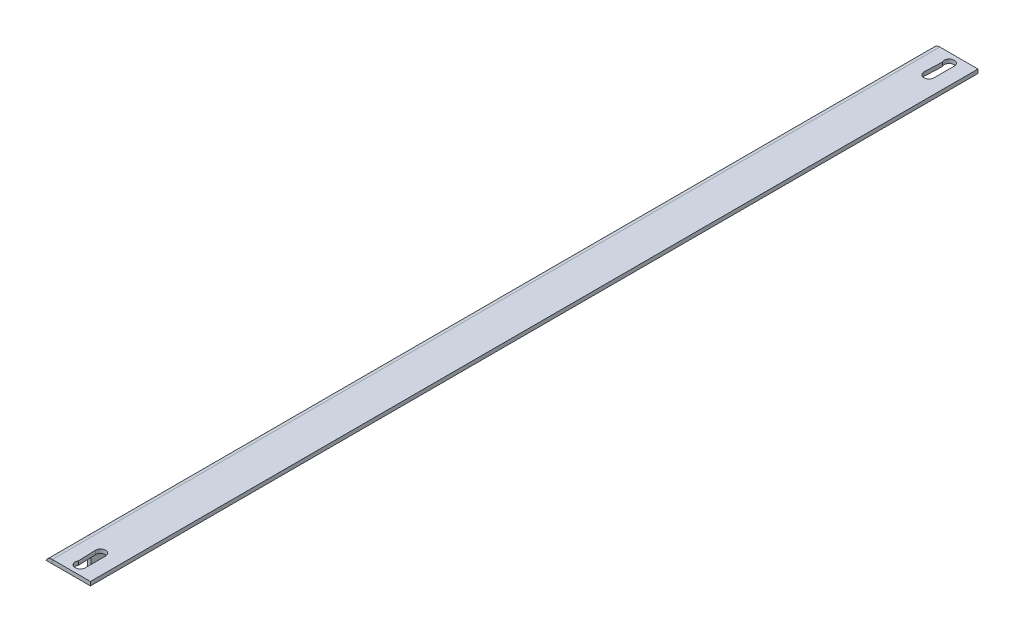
ISO-10303-21;
HEADER;
FILE_DESCRIPTION(('STEP AP214'),'2;1');
FILE_NAME('part.step','',(''),(''),'','','');
FILE_SCHEMA(('AUTOMOTIVE_DESIGN { 1 0 10303 214 1 1 1 1 }'));
ENDSEC;
DATA;
#1=APPLICATION_CONTEXT('core data for automotive mechanical design processes');
#2=APPLICATION_PROTOCOL_DEFINITION('international standard','automotive_design',2000,#1);
#3=PRODUCT_CONTEXT('',#1,'mechanical');
#4=PRODUCT('Part','Part','',(#3));
#5=PRODUCT_RELATED_PRODUCT_CATEGORY('part','',(#4));
#6=PRODUCT_DEFINITION_FORMATION('','',#4);
#7=PRODUCT_DEFINITION_CONTEXT('part definition',#1,'design');
#8=PRODUCT_DEFINITION('design','',#6,#7);
#9=PRODUCT_DEFINITION_SHAPE('','',#8);
#10=(LENGTH_UNIT() NAMED_UNIT(*) SI_UNIT(.MILLI.,.METRE.));
#11=(NAMED_UNIT(*) PLANE_ANGLE_UNIT() SI_UNIT($,.RADIAN.));
#12=(NAMED_UNIT(*) SI_UNIT($,.STERADIAN.) SOLID_ANGLE_UNIT());
#13=UNCERTAINTY_MEASURE_WITH_UNIT(LENGTH_MEASURE(1.E-05),#10,'distance_accuracy_value','');
#14=(GEOMETRIC_REPRESENTATION_CONTEXT(3) GLOBAL_UNCERTAINTY_ASSIGNED_CONTEXT((#13)) GLOBAL_UNIT_ASSIGNED_CONTEXT((#10,
#11,#12)) REPRESENTATION_CONTEXT('',''));
#15=CARTESIAN_POINT('',(0.,0.,0.));
#16=DIRECTION('',(0.,0.,1.));
#17=DIRECTION('',(1.,0.,0.));
#18=AXIS2_PLACEMENT_3D('',#15,#16,#17);
#19=CARTESIAN_POINT('',(-21.0535097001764,47.6637389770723,570.));
#20=DIRECTION('',(0.,1.,0.));
#21=DIRECTION('',(0.,0.,1.));
#22=AXIS2_PLACEMENT_3D('',#19,#20,#21);
#23=PLANE('',#22);
#24=DIRECTION('',(0.,0.,-1.));
#25=VECTOR('',#24,1.);
#26=CARTESIAN_POINT('',(-17.0535097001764,47.6637389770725,-570.));
#27=LINE('',#26,#25);
#28=CARTESIAN_POINT('',(-17.0535097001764,47.6637389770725,516.));
#29=VERTEX_POINT('',#28);
#30=CARTESIAN_POINT('',(-17.0535097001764,47.6637389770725,-516.));
#31=VERTEX_POINT('',#30);
#32=EDGE_CURVE('E356',#29,#31,#27,.T.);
#33=ORIENTED_EDGE('',*,*,#32,.T.);
#34=DIRECTION('',(1.,0.,0.));
#35=VECTOR('',#34,1.);
#36=CARTESIAN_POINT('',(-91.0535097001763,47.6637389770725,-516.));
#37=LINE('',#36,#35);
#38=CARTESIAN_POINT('',(-25.1157674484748,47.6637389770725,-516.));
#39=VERTEX_POINT('',#38);
#40=EDGE_CURVE('E288',#39,#31,#37,.T.);
#41=ORIENTED_EDGE('',*,*,#40,.F.);
#42=DIRECTION('',(0.,0.,1.));
#43=VECTOR('',#42,1.);
#44=CARTESIAN_POINT('',(-25.1157674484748,47.6637389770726,-1715.51287387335));
#45=LINE('',#44,#43);
#46=CARTESIAN_POINT('',(-25.1157674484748,47.6637389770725,-570.));
#47=VERTEX_POINT('',#46);
#48=EDGE_CURVE('E290',#39,#47,#45,.F.);
#49=ORIENTED_EDGE('',*,*,#48,.T.);
#50=DIRECTION('',(1.,0.,0.));
#51=VECTOR('',#50,1.);
#52=CARTESIAN_POINT('',(-91.0535097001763,47.6637389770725,-570.));
#53=LINE('',#52,#51);
#54=CARTESIAN_POINT('',(-17.0535097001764,47.6637389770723,-570.));
#55=VERTEX_POINT('',#54);
#56=EDGE_CURVE('E287',#47,#55,#53,.T.);
#57=ORIENTED_EDGE('',*,*,#56,.T.);
#58=DIRECTION('',(1.,0.,0.));
#59=VECTOR('',#58,1.);
#60=CARTESIAN_POINT('',(-21.0535097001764,47.6637389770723,-570.));
#61=LINE('',#60,#59);
#62=CARTESIAN_POINT('',(31.9464902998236,47.6637389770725,-570.));
#63=VERTEX_POINT('',#62);
#64=EDGE_CURVE('E351',#55,#63,#61,.T.);
#65=ORIENTED_EDGE('',*,*,#64,.T.);
#66=DIRECTION('',(0.,0.,-1.));
#67=VECTOR('',#66,1.);
#68=CARTESIAN_POINT('',(31.9464902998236,47.6637389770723,570.));
#69=LINE('',#68,#67);
#70=CARTESIAN_POINT('',(31.9464902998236,47.6637389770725,570.));
#71=VERTEX_POINT('',#70);
#72=EDGE_CURVE('E354',#71,#63,#69,.T.);
#73=ORIENTED_EDGE('',*,*,#72,.F.);
#74=DIRECTION('',(-1.,0.,0.));
#75=VECTOR('',#74,1.);
#76=CARTESIAN_POINT('',(-21.0535097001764,47.6637389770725,570.));
#77=LINE('',#76,#75);
#78=CARTESIAN_POINT('',(-17.0535097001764,47.6637389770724,569.999999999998));
#79=VERTEX_POINT('',#78);
#80=EDGE_CURVE('E370',#71,#79,#77,.T.);
#81=ORIENTED_EDGE('',*,*,#80,.T.);
#82=DIRECTION('',(-1.,0.,0.));
#83=VECTOR('',#82,1.);
#84=CARTESIAN_POINT('',(-17.0535097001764,47.6637389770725,570.));
#85=LINE('',#84,#83);
#86=CARTESIAN_POINT('',(-25.1157674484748,47.6637389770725,570.));
#87=VERTEX_POINT('',#86);
#88=EDGE_CURVE('E319',#79,#87,#85,.T.);
#89=ORIENTED_EDGE('',*,*,#88,.T.);
#90=DIRECTION('',(0.,0.,1.));
#91=VECTOR('',#90,1.);
#92=CARTESIAN_POINT('',(-25.1157674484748,47.6637389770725,-1715.51287387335));
#93=LINE('',#92,#91);
#94=CARTESIAN_POINT('',(-25.1157674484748,47.6637389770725,516.));
#95=VERTEX_POINT('',#94);
#96=EDGE_CURVE('E321',#87,#95,#93,.F.);
#97=ORIENTED_EDGE('',*,*,#96,.T.);
#98=DIRECTION('',(1.,0.,0.));
#99=VECTOR('',#98,1.);
#100=CARTESIAN_POINT('',(-91.0535097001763,47.6637389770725,516.));
#101=LINE('',#100,#99);
#102=EDGE_CURVE('E304',#95,#29,#101,.T.);
#103=ORIENTED_EDGE('',*,*,#102,.T.);
#104=EDGE_LOOP('',(#33,#41,#49,#57,#65,#73,#81,#89,#97,#103));
#105=FACE_BOUND('',#104,.T.);
#106=DIRECTION('',(0.0384616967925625,0.,0.99926007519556));
#107=VECTOR('',#106,1.);
#108=CARTESIAN_POINT('',(1.87034239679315,47.6637389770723,569.117656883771));
#109=LINE('',#108,#107);
#110=CARTESIAN_POINT('',(0.45129981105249,47.6637389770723,532.250001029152));
#111=VERTEX_POINT('',#110);
#112=CARTESIAN_POINT('',(1.31732852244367,47.6637389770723,554.749994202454));
#113=VERTEX_POINT('',#112);
#114=EDGE_CURVE('E221',#111,#113,#109,.T.);
#115=ORIENTED_EDGE('',*,*,#114,.T.);
#116=CARTESIAN_POINT('',(6.94649029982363,47.6637389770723,558.));
#117=DIRECTION('',(0.,1.,0.));
#118=DIRECTION('',(0.,0.,1.));
#119=AXIS2_PLACEMENT_3D('',#116,#117,#118);
#120=CIRCLE('',#119,6.5);
#121=CARTESIAN_POINT('',(13.4464902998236,47.6637389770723,558.));
#122=VERTEX_POINT('',#121);
#123=EDGE_CURVE('E224',#113,#122,#120,.T.);
#124=ORIENTED_EDGE('',*,*,#123,.T.);
#125=DIRECTION('',(0.,0.,-1.));
#126=VECTOR('',#125,1.);
#127=CARTESIAN_POINT('',(13.4464902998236,47.6637389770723,570.));
#128=LINE('',#127,#126);
#129=CARTESIAN_POINT('',(13.4464902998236,47.6637389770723,532.));
#130=VERTEX_POINT('',#129);
#131=EDGE_CURVE('E209',#122,#130,#128,.T.);
#132=ORIENTED_EDGE('',*,*,#131,.T.);
#133=CARTESIAN_POINT('',(6.94649029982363,47.6637389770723,532.));
#134=DIRECTION('',(0.,1.,0.));
#135=DIRECTION('',(0.,0.,1.));
#136=AXIS2_PLACEMENT_3D('',#133,#134,#135);
#137=CIRCLE('',#136,6.5);
#138=EDGE_CURVE('E218',#130,#111,#137,.T.);
#139=ORIENTED_EDGE('',*,*,#138,.T.);
#140=EDGE_LOOP('',(#115,#124,#132,#139));
#141=FACE_BOUND('',#140,.T.);
#142=CARTESIAN_POINT('',(6.94649029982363,47.6637389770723,-558.));
#143=DIRECTION('',(0.,1.,0.));
#144=DIRECTION('',(0.,0.,1.));
#145=AXIS2_PLACEMENT_3D('',#142,#143,#144);
#146=CIRCLE('',#145,6.5);
#147=CARTESIAN_POINT('',(1.31732852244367,47.6637389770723,-554.749994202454));
#148=VERTEX_POINT('',#147);
#149=CARTESIAN_POINT('',(13.4464902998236,47.6637389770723,-558.));
#150=VERTEX_POINT('',#149);
#151=EDGE_CURVE('E193',#148,#150,#146,.F.);
#152=ORIENTED_EDGE('',*,*,#151,.F.);
#153=DIRECTION('',(0.0384616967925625,0.,-0.99926007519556));
#154=VECTOR('',#153,1.);
#155=CARTESIAN_POINT('',(-41.9435489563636,47.6637389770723,569.195938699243));
#156=LINE('',#155,#154);
#157=CARTESIAN_POINT('',(0.451299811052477,47.6637389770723,-532.250001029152));
#158=VERTEX_POINT('',#157);
#159=EDGE_CURVE('E186',#158,#148,#156,.T.);
#160=ORIENTED_EDGE('',*,*,#159,.F.);
#161=CARTESIAN_POINT('',(6.94649029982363,47.6637389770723,-532.));
#162=DIRECTION('',(0.,1.,0.));
#163=DIRECTION('',(0.,0.,1.));
#164=AXIS2_PLACEMENT_3D('',#161,#162,#163);
#165=CIRCLE('',#164,6.5);
#166=CARTESIAN_POINT('',(13.4464902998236,47.6637389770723,-532.));
#167=VERTEX_POINT('',#166);
#168=EDGE_CURVE('E167',#167,#158,#165,.F.);
#169=ORIENTED_EDGE('',*,*,#168,.F.);
#170=DIRECTION('',(0.,0.,1.));
#171=VECTOR('',#170,1.);
#172=CARTESIAN_POINT('',(13.4464902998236,47.6637389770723,570.));
#173=LINE('',#172,#171);
#174=EDGE_CURVE('E191',#150,#167,#173,.T.);
#175=ORIENTED_EDGE('',*,*,#174,.F.);
#176=EDGE_LOOP('',(#152,#160,#169,#175));
#177=FACE_BOUND('',#176,.T.);
#178=ADVANCED_FACE('F30',(#105,#141,#177),#23,.F.);
#179=CARTESIAN_POINT('',(31.9464902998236,52.6637389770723,570.));
#180=DIRECTION('',(0.,-1.,0.));
#181=DIRECTION('',(1.,0.,0.));
#182=AXIS2_PLACEMENT_3D('',#179,#180,#181);
#183=PLANE('',#182);
#184=DIRECTION('',(-1.,0.,0.));
#185=VECTOR('',#184,1.);
#186=CARTESIAN_POINT('',(31.9464902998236,52.6637389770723,-570.));
#187=LINE('',#186,#185);
#188=CARTESIAN_POINT('',(31.9464902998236,52.6637389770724,-570.));
#189=VERTEX_POINT('',#188);
#190=CARTESIAN_POINT('',(-17.0535097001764,52.6637389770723,-570.));
#191=VERTEX_POINT('',#190);
#192=EDGE_CURVE('E332',#189,#191,#187,.T.);
#193=ORIENTED_EDGE('',*,*,#192,.T.);
#194=DIRECTION('',(0.,0.,1.));
#195=VECTOR('',#194,1.);
#196=CARTESIAN_POINT('',(-17.0535097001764,52.6637389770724,-570.));
#197=LINE('',#196,#195);
#198=CARTESIAN_POINT('',(-17.0535097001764,52.6637389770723,570.));
#199=VERTEX_POINT('',#198);
#200=EDGE_CURVE('E348',#191,#199,#197,.T.);
#201=ORIENTED_EDGE('',*,*,#200,.T.);
#202=DIRECTION('',(-1.,0.,0.));
#203=VECTOR('',#202,1.);
#204=CARTESIAN_POINT('',(31.9464902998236,52.6637389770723,570.));
#205=LINE('',#204,#203);
#206=CARTESIAN_POINT('',(31.9464902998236,52.6637389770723,570.));
#207=VERTEX_POINT('',#206);
#208=EDGE_CURVE('E342',#207,#199,#205,.T.);
#209=ORIENTED_EDGE('',*,*,#208,.F.);
#210=DIRECTION('',(0.,0.,-1.));
#211=VECTOR('',#210,1.);
#212=CARTESIAN_POINT('',(31.9464902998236,52.6637389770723,570.));
#213=LINE('',#212,#211);
#214=EDGE_CURVE('E345',#207,#189,#213,.T.);
#215=ORIENTED_EDGE('',*,*,#214,.T.);
#216=EDGE_LOOP('',(#193,#201,#209,#215));
#217=FACE_BOUND('',#216,.T.);
#218=DIRECTION('',(0.,0.,-1.));
#219=VECTOR('',#218,1.);
#220=CARTESIAN_POINT('',(13.4464902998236,52.6637389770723,558.));
#221=LINE('',#220,#219);
#222=CARTESIAN_POINT('',(13.4464902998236,52.6637389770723,558.));
#223=VERTEX_POINT('',#222);
#224=CARTESIAN_POINT('',(13.4464902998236,52.6637389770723,532.));
#225=VERTEX_POINT('',#224);
#226=EDGE_CURVE('E197',#223,#225,#221,.T.);
#227=ORIENTED_EDGE('',*,*,#226,.F.);
#228=CARTESIAN_POINT('',(6.94649029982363,52.6637389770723,558.));
#229=DIRECTION('',(0.,1.,0.));
#230=DIRECTION('',(-1.,0.,0.));
#231=AXIS2_PLACEMENT_3D('',#228,#229,#230);
#232=CIRCLE('',#231,6.5);
#233=CARTESIAN_POINT('',(1.31732852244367,52.6637389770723,554.749994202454));
#234=VERTEX_POINT('',#233);
#235=EDGE_CURVE('E195',#234,#223,#232,.T.);
#236=ORIENTED_EDGE('',*,*,#235,.F.);
#237=DIRECTION('',(0.0384616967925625,0.,0.99926007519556));
#238=VECTOR('',#237,1.);
#239=CARTESIAN_POINT('',(1.31732852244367,52.6637389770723,554.749994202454));
#240=LINE('',#239,#238);
#241=CARTESIAN_POINT('',(0.451299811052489,52.6637389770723,532.250001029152));
#242=VERTEX_POINT('',#241);
#243=EDGE_CURVE('E203',#242,#234,#240,.T.);
#244=ORIENTED_EDGE('',*,*,#243,.F.);
#245=CARTESIAN_POINT('',(6.94649029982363,52.6637389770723,532.));
#246=DIRECTION('',(0.,1.,0.));
#247=DIRECTION('',(-1.,0.,0.));
#248=AXIS2_PLACEMENT_3D('',#245,#246,#247);
#249=CIRCLE('',#248,6.5);
#250=EDGE_CURVE('E200',#225,#242,#249,.T.);
#251=ORIENTED_EDGE('',*,*,#250,.F.);
#252=EDGE_LOOP('',(#227,#236,#244,#251));
#253=FACE_BOUND('',#252,.T.);
#254=CARTESIAN_POINT('',(6.94649029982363,52.6637389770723,-558.));
#255=DIRECTION('',(0.,-1.,0.));
#256=DIRECTION('',(-1.,0.,0.));
#257=AXIS2_PLACEMENT_3D('',#254,#255,#256);
#258=CIRCLE('',#257,6.5);
#259=CARTESIAN_POINT('',(1.31732852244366,52.6637389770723,-554.749994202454));
#260=VERTEX_POINT('',#259);
#261=CARTESIAN_POINT('',(13.4464902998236,52.6637389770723,-558.));
#262=VERTEX_POINT('',#261);
#263=EDGE_CURVE('E53',#260,#262,#258,.T.);
#264=ORIENTED_EDGE('',*,*,#263,.T.);
#265=DIRECTION('',(0.,0.,1.));
#266=VECTOR('',#265,1.);
#267=CARTESIAN_POINT('',(13.4464902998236,52.6637389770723,-558.));
#268=LINE('',#267,#266);
#269=CARTESIAN_POINT('',(13.4464902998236,52.6637389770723,-532.));
#270=VERTEX_POINT('',#269);
#271=EDGE_CURVE('E179',#262,#270,#268,.T.);
#272=ORIENTED_EDGE('',*,*,#271,.T.);
#273=CARTESIAN_POINT('',(6.94649029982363,52.6637389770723,-532.));
#274=DIRECTION('',(0.,-1.,0.));
#275=DIRECTION('',(-1.,0.,0.));
#276=AXIS2_PLACEMENT_3D('',#273,#274,#275);
#277=CIRCLE('',#276,6.5);
#278=CARTESIAN_POINT('',(0.451299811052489,52.6637389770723,-532.250001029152));
#279=VERTEX_POINT('',#278);
#280=EDGE_CURVE('E164',#270,#279,#277,.T.);
#281=ORIENTED_EDGE('',*,*,#280,.T.);
#282=DIRECTION('',(0.0384616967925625,0.,-0.99926007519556));
#283=VECTOR('',#282,1.);
#284=CARTESIAN_POINT('',(1.31732852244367,52.6637389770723,-554.749994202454));
#285=LINE('',#284,#283);
#286=EDGE_CURVE('E173',#279,#260,#285,.T.);
#287=ORIENTED_EDGE('',*,*,#286,.T.);
#288=EDGE_LOOP('',(#264,#272,#281,#287));
#289=FACE_BOUND('',#288,.T.);
#290=ADVANCED_FACE('F177',(#217,#253,#289),#183,.F.);
#291=CARTESIAN_POINT('',(-21.0535097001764,-2234.44142950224,-570.));
#292=DIRECTION('',(0.,0.,1.));
#293=DIRECTION('',(0.,-1.,0.));
#294=AXIS2_PLACEMENT_3D('',#291,#292,#293);
#295=PLANE('',#294);
#296=DIRECTION('',(0.,1.,0.));
#297=VECTOR('',#296,1.);
#298=CARTESIAN_POINT('',(-17.0535097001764,-2234.44142950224,-570.));
#299=LINE('',#298,#297);
#300=EDGE_CURVE('E367',#55,#191,#299,.T.);
#301=ORIENTED_EDGE('',*,*,#300,.T.);
#302=ORIENTED_EDGE('',*,*,#192,.F.);
#303=DIRECTION('',(0.,1.,0.));
#304=VECTOR('',#303,1.);
#305=CARTESIAN_POINT('',(31.9464902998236,-2234.44142950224,-570.));
#306=LINE('',#305,#304);
#307=EDGE_CURVE('E364',#63,#189,#306,.T.);
#308=ORIENTED_EDGE('',*,*,#307,.F.);
#309=ORIENTED_EDGE('',*,*,#64,.F.);
#310=EDGE_LOOP('',(#301,#302,#308,#309));
#311=FACE_BOUND('',#310,.T.);
#312=ADVANCED_FACE('F32',(#311),#295,.F.);
#313=CARTESIAN_POINT('',(31.9464902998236,-2234.44142950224,570.));
#314=DIRECTION('',(1.,0.,0.));
#315=DIRECTION('',(0.,1.,0.));
#316=AXIS2_PLACEMENT_3D('',#313,#314,#315);
#317=PLANE('',#316);
#318=ORIENTED_EDGE('',*,*,#214,.F.);
#319=DIRECTION('',(0.,1.,0.));
#320=VECTOR('',#319,1.);
#321=CARTESIAN_POINT('',(31.9464902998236,-2234.44142950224,570.));
#322=LINE('',#321,#320);
#323=EDGE_CURVE('E362',#71,#207,#322,.T.);
#324=ORIENTED_EDGE('',*,*,#323,.F.);
#325=ORIENTED_EDGE('',*,*,#72,.T.);
#326=ORIENTED_EDGE('',*,*,#307,.T.);
#327=EDGE_LOOP('',(#318,#324,#325,#326));
#328=FACE_BOUND('',#327,.T.);
#329=ADVANCED_FACE('F410',(#328),#317,.T.);
#330=CARTESIAN_POINT('',(-21.0535097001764,-2234.44142950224,570.));
#331=DIRECTION('',(0.,0.,1.));
#332=DIRECTION('',(0.,-1.,0.));
#333=AXIS2_PLACEMENT_3D('',#330,#331,#332);
#334=PLANE('',#333);
#335=ORIENTED_EDGE('',*,*,#208,.T.);
#336=DIRECTION('',(0.,1.,0.));
#337=VECTOR('',#336,1.);
#338=CARTESIAN_POINT('',(-17.0535097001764,-2234.44142950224,570.));
#339=LINE('',#338,#337);
#340=EDGE_CURVE('E359',#79,#199,#339,.T.);
#341=ORIENTED_EDGE('',*,*,#340,.F.);
#342=ORIENTED_EDGE('',*,*,#80,.F.);
#343=ORIENTED_EDGE('',*,*,#323,.T.);
#344=EDGE_LOOP('',(#335,#341,#342,#343));
#345=FACE_BOUND('',#344,.T.);
#346=ADVANCED_FACE('F413',(#345),#334,.T.);
#347=CARTESIAN_POINT('',(2261.05165877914,-5.3362610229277,570.));
#348=DIRECTION('',(0.,1.,0.));
#349=DIRECTION('',(0.,0.,1.));
#350=AXIS2_PLACEMENT_3D('',#347,#348,#349);
#351=PLANE('',#350);
#352=DIRECTION('',(0.,0.,-1.));
#353=VECTOR('',#352,1.);
#354=CARTESIAN_POINT('',(-26.0535097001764,-5.3362610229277,570.));
#355=LINE('',#354,#353);
#356=CARTESIAN_POINT('',(-26.0535097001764,-5.3362610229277,516.));
#357=VERTEX_POINT('',#356);
#358=CARTESIAN_POINT('',(-26.0535097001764,-5.3362610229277,-516.));
#359=VERTEX_POINT('',#358);
#360=EDGE_CURVE('E333',#357,#359,#355,.T.);
#361=ORIENTED_EDGE('',*,*,#360,.T.);
#362=DIRECTION('',(1.,0.,0.));
#363=VECTOR('',#362,1.);
#364=CARTESIAN_POINT('',(2261.05165877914,-5.3362610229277,-516.));
#365=LINE('',#364,#363);
#366=CARTESIAN_POINT('',(-21.0535097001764,-5.3362610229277,-516.));
#367=VERTEX_POINT('',#366);
#368=EDGE_CURVE('E296',#359,#367,#365,.T.);
#369=ORIENTED_EDGE('',*,*,#368,.T.);
#370=DIRECTION('',(0.,0.,-1.));
#371=VECTOR('',#370,1.);
#372=CARTESIAN_POINT('',(-21.0535097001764,-5.3362610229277,570.));
#373=LINE('',#372,#371);
#374=CARTESIAN_POINT('',(-21.0535097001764,-5.3362610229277,516.));
#375=VERTEX_POINT('',#374);
#376=EDGE_CURVE('E329',#375,#367,#373,.T.);
#377=ORIENTED_EDGE('',*,*,#376,.F.);
#378=DIRECTION('',(-1.,0.,0.));
#379=VECTOR('',#378,1.);
#380=CARTESIAN_POINT('',(2261.05165877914,-5.3362610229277,516.));
#381=LINE('',#380,#379);
#382=EDGE_CURVE('E310',#375,#357,#381,.T.);
#383=ORIENTED_EDGE('',*,*,#382,.T.);
#384=EDGE_LOOP('',(#361,#369,#377,#383));
#385=FACE_BOUND('',#384,.T.);
#386=ADVANCED_FACE('F385',(#385),#351,.F.);
#387=CARTESIAN_POINT('',(-21.0535097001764,-5.3362610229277,570.));
#388=DIRECTION('',(-1.,0.,0.));
#389=DIRECTION('',(0.,0.,1.));
#390=AXIS2_PLACEMENT_3D('',#387,#388,#389);
#391=PLANE('',#390);
#392=CARTESIAN_POINT('',(-21.0535097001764,19.6637389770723,-450.));
#393=DIRECTION('',(1.,0.,0.));
#394=DIRECTION('',(0.,0.,-1.));
#395=AXIS2_PLACEMENT_3D('',#392,#393,#394);
#396=CIRCLE('',#395,6.4999999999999);
#397=CARTESIAN_POINT('',(-21.0535097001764,19.6637389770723,-456.5));
#398=VERTEX_POINT('',#397);
#399=EDGE_CURVE('E227',#398,#398,#396,.T.);
#400=ORIENTED_EDGE('',*,*,#399,.F.);
#401=EDGE_LOOP('',(#400));
#402=FACE_BOUND('',#401,.T.);
#403=CARTESIAN_POINT('',(-21.0535097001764,19.6637389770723,-350.));
#404=DIRECTION('',(1.,0.,0.));
#405=DIRECTION('',(0.,0.,-1.));
#406=AXIS2_PLACEMENT_3D('',#403,#404,#405);
#407=CIRCLE('',#406,6.4999999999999);
#408=CARTESIAN_POINT('',(-21.0535097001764,19.6637389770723,-356.5));
#409=VERTEX_POINT('',#408);
#410=EDGE_CURVE('E233',#409,#409,#407,.T.);
#411=ORIENTED_EDGE('',*,*,#410,.F.);
#412=EDGE_LOOP('',(#411));
#413=FACE_BOUND('',#412,.T.);
#414=CARTESIAN_POINT('',(-21.0535097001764,19.6637389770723,-250.));
#415=DIRECTION('',(1.,0.,0.));
#416=DIRECTION('',(0.,0.,-1.));
#417=AXIS2_PLACEMENT_3D('',#414,#415,#416);
#418=CIRCLE('',#417,6.4999999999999);
#419=CARTESIAN_POINT('',(-21.0535097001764,19.6637389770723,-256.5));
#420=VERTEX_POINT('',#419);
#421=EDGE_CURVE('E239',#420,#420,#418,.T.);
#422=ORIENTED_EDGE('',*,*,#421,.F.);
#423=EDGE_LOOP('',(#422));
#424=FACE_BOUND('',#423,.T.);
#425=CARTESIAN_POINT('',(-21.0535097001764,19.6637389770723,-150.));
#426=DIRECTION('',(1.,0.,0.));
#427=DIRECTION('',(0.,0.,-1.));
#428=AXIS2_PLACEMENT_3D('',#425,#426,#427);
#429=CIRCLE('',#428,6.4999999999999);
#430=CARTESIAN_POINT('',(-21.0535097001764,19.6637389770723,-156.5));
#431=VERTEX_POINT('',#430);
#432=EDGE_CURVE('E245',#431,#431,#429,.T.);
#433=ORIENTED_EDGE('',*,*,#432,.F.);
#434=EDGE_LOOP('',(#433));
#435=FACE_BOUND('',#434,.T.);
#436=CARTESIAN_POINT('',(-21.0535097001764,19.6637389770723,-50.));
#437=DIRECTION('',(1.,0.,0.));
#438=DIRECTION('',(0.,0.,-1.));
#439=AXIS2_PLACEMENT_3D('',#436,#437,#438);
#440=CIRCLE('',#439,6.4999999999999);
#441=CARTESIAN_POINT('',(-21.0535097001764,19.6637389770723,-56.4999999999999));
#442=VERTEX_POINT('',#441);
#443=EDGE_CURVE('E251',#442,#442,#440,.T.);
#444=ORIENTED_EDGE('',*,*,#443,.F.);
#445=EDGE_LOOP('',(#444));
#446=FACE_BOUND('',#445,.T.);
#447=CARTESIAN_POINT('',(-21.0535097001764,19.6637389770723,50.));
#448=DIRECTION('',(1.,0.,0.));
#449=DIRECTION('',(0.,0.,-1.));
#450=AXIS2_PLACEMENT_3D('',#447,#448,#449);
#451=CIRCLE('',#450,6.4999999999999);
#452=CARTESIAN_POINT('',(-21.0535097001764,19.6637389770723,43.5000000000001));
#453=VERTEX_POINT('',#452);
#454=EDGE_CURVE('E257',#453,#453,#451,.T.);
#455=ORIENTED_EDGE('',*,*,#454,.F.);
#456=EDGE_LOOP('',(#455));
#457=FACE_BOUND('',#456,.T.);
#458=CARTESIAN_POINT('',(-21.0535097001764,19.6637389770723,150.));
#459=DIRECTION('',(1.,0.,0.));
#460=DIRECTION('',(0.,0.,-1.));
#461=AXIS2_PLACEMENT_3D('',#458,#459,#460);
#462=CIRCLE('',#461,6.4999999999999);
#463=CARTESIAN_POINT('',(-21.0535097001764,19.6637389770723,143.5));
#464=VERTEX_POINT('',#463);
#465=EDGE_CURVE('E263',#464,#464,#462,.T.);
#466=ORIENTED_EDGE('',*,*,#465,.F.);
#467=EDGE_LOOP('',(#466));
#468=FACE_BOUND('',#467,.T.);
#469=CARTESIAN_POINT('',(-21.0535097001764,19.6637389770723,250.));
#470=DIRECTION('',(1.,0.,0.));
#471=DIRECTION('',(0.,0.,-1.));
#472=AXIS2_PLACEMENT_3D('',#469,#470,#471);
#473=CIRCLE('',#472,6.4999999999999);
#474=CARTESIAN_POINT('',(-21.0535097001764,19.6637389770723,243.5));
#475=VERTEX_POINT('',#474);
#476=EDGE_CURVE('E269',#475,#475,#473,.T.);
#477=ORIENTED_EDGE('',*,*,#476,.F.);
#478=EDGE_LOOP('',(#477));
#479=FACE_BOUND('',#478,.T.);
#480=CARTESIAN_POINT('',(-21.0535097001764,19.6637389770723,350.));
#481=DIRECTION('',(1.,0.,0.));
#482=DIRECTION('',(0.,0.,-1.));
#483=AXIS2_PLACEMENT_3D('',#480,#481,#482);
#484=CIRCLE('',#483,6.4999999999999);
#485=CARTESIAN_POINT('',(-21.0535097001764,19.6637389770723,343.5));
#486=VERTEX_POINT('',#485);
#487=EDGE_CURVE('E275',#486,#486,#484,.T.);
#488=ORIENTED_EDGE('',*,*,#487,.F.);
#489=EDGE_LOOP('',(#488));
#490=FACE_BOUND('',#489,.T.);
#491=CARTESIAN_POINT('',(-21.0535097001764,19.6637389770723,450.));
#492=DIRECTION('',(1.,0.,0.));
#493=DIRECTION('',(0.,0.,-1.));
#494=AXIS2_PLACEMENT_3D('',#491,#492,#493);
#495=CIRCLE('',#494,6.4999999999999);
#496=CARTESIAN_POINT('',(-21.0535097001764,19.6637389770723,443.5));
#497=VERTEX_POINT('',#496);
#498=EDGE_CURVE('E281',#497,#497,#495,.T.);
#499=ORIENTED_EDGE('',*,*,#498,.F.);
#500=EDGE_LOOP('',(#499));
#501=FACE_BOUND('',#500,.T.);
#502=ORIENTED_EDGE('',*,*,#376,.T.);
#503=DIRECTION('',(0.,1.,0.));
#504=VECTOR('',#503,1.);
#505=CARTESIAN_POINT('',(-21.0535097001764,-5.3362610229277,-516.));
#506=LINE('',#505,#504);
#507=CARTESIAN_POINT('',(-21.0535097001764,43.6637389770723,-516.));
#508=VERTEX_POINT('',#507);
#509=EDGE_CURVE('E293',#367,#508,#506,.T.);
#510=ORIENTED_EDGE('',*,*,#509,.T.);
#511=DIRECTION('',(0.,0.,-1.));
#512=VECTOR('',#511,1.);
#513=CARTESIAN_POINT('',(-21.0535097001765,43.6637389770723,-570.));
#514=LINE('',#513,#512);
#515=CARTESIAN_POINT('',(-21.0535097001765,43.6637389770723,516.));
#516=VERTEX_POINT('',#515);
#517=EDGE_CURVE('E328',#516,#508,#514,.T.);
#518=ORIENTED_EDGE('',*,*,#517,.F.);
#519=DIRECTION('',(0.,-1.,0.));
#520=VECTOR('',#519,1.);
#521=CARTESIAN_POINT('',(-21.0535097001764,-5.3362610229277,516.));
#522=LINE('',#521,#520);
#523=EDGE_CURVE('E307',#516,#375,#522,.T.);
#524=ORIENTED_EDGE('',*,*,#523,.T.);
#525=EDGE_LOOP('',(#502,#510,#518,#524));
#526=FACE_BOUND('',#525,.T.);
#527=ADVANCED_FACE('F380',(#402,#413,#424,#435,#446,#457,#468,#479,#490,#501,#526),#391,.F.);
#528=CARTESIAN_POINT('',(-26.0535097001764,52.6637389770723,570.));
#529=DIRECTION('',(1.,0.,0.));
#530=DIRECTION('',(0.,1.,0.));
#531=AXIS2_PLACEMENT_3D('',#528,#529,#530);
#532=PLANE('',#531);
#533=CARTESIAN_POINT('',(-26.0535097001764,19.6637389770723,-450.));
#534=DIRECTION('',(1.,0.,0.));
#535=DIRECTION('',(0.,0.,-1.));
#536=AXIS2_PLACEMENT_3D('',#533,#534,#535);
#537=CIRCLE('',#536,6.4999999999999);
#538=CARTESIAN_POINT('',(-26.0535097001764,19.6637389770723,-456.5));
#539=VERTEX_POINT('',#538);
#540=EDGE_CURVE('E230',#539,#539,#537,.T.);
#541=ORIENTED_EDGE('',*,*,#540,.T.);
#542=EDGE_LOOP('',(#541));
#543=FACE_BOUND('',#542,.T.);
#544=CARTESIAN_POINT('',(-26.0535097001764,19.6637389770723,-350.));
#545=DIRECTION('',(1.,0.,0.));
#546=DIRECTION('',(0.,0.,-1.));
#547=AXIS2_PLACEMENT_3D('',#544,#545,#546);
#548=CIRCLE('',#547,6.4999999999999);
#549=CARTESIAN_POINT('',(-26.0535097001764,19.6637389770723,-356.5));
#550=VERTEX_POINT('',#549);
#551=EDGE_CURVE('E236',#550,#550,#548,.T.);
#552=ORIENTED_EDGE('',*,*,#551,.T.);
#553=EDGE_LOOP('',(#552));
#554=FACE_BOUND('',#553,.T.);
#555=CARTESIAN_POINT('',(-26.0535097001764,19.6637389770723,-250.));
#556=DIRECTION('',(1.,0.,0.));
#557=DIRECTION('',(0.,0.,-1.));
#558=AXIS2_PLACEMENT_3D('',#555,#556,#557);
#559=CIRCLE('',#558,6.4999999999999);
#560=CARTESIAN_POINT('',(-26.0535097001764,19.6637389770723,-256.5));
#561=VERTEX_POINT('',#560);
#562=EDGE_CURVE('E242',#561,#561,#559,.T.);
#563=ORIENTED_EDGE('',*,*,#562,.T.);
#564=EDGE_LOOP('',(#563));
#565=FACE_BOUND('',#564,.T.);
#566=CARTESIAN_POINT('',(-26.0535097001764,19.6637389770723,-150.));
#567=DIRECTION('',(1.,0.,0.));
#568=DIRECTION('',(0.,0.,-1.));
#569=AXIS2_PLACEMENT_3D('',#566,#567,#568);
#570=CIRCLE('',#569,6.4999999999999);
#571=CARTESIAN_POINT('',(-26.0535097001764,19.6637389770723,-156.5));
#572=VERTEX_POINT('',#571);
#573=EDGE_CURVE('E248',#572,#572,#570,.T.);
#574=ORIENTED_EDGE('',*,*,#573,.T.);
#575=EDGE_LOOP('',(#574));
#576=FACE_BOUND('',#575,.T.);
#577=CARTESIAN_POINT('',(-26.0535097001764,19.6637389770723,-50.));
#578=DIRECTION('',(1.,0.,0.));
#579=DIRECTION('',(0.,0.,-1.));
#580=AXIS2_PLACEMENT_3D('',#577,#578,#579);
#581=CIRCLE('',#580,6.4999999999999);
#582=CARTESIAN_POINT('',(-26.0535097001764,19.6637389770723,-56.4999999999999));
#583=VERTEX_POINT('',#582);
#584=EDGE_CURVE('E254',#583,#583,#581,.T.);
#585=ORIENTED_EDGE('',*,*,#584,.T.);
#586=EDGE_LOOP('',(#585));
#587=FACE_BOUND('',#586,.T.);
#588=CARTESIAN_POINT('',(-26.0535097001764,19.6637389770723,50.));
#589=DIRECTION('',(1.,0.,0.));
#590=DIRECTION('',(0.,0.,-1.));
#591=AXIS2_PLACEMENT_3D('',#588,#589,#590);
#592=CIRCLE('',#591,6.4999999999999);
#593=CARTESIAN_POINT('',(-26.0535097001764,19.6637389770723,43.5000000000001));
#594=VERTEX_POINT('',#593);
#595=EDGE_CURVE('E260',#594,#594,#592,.T.);
#596=ORIENTED_EDGE('',*,*,#595,.T.);
#597=EDGE_LOOP('',(#596));
#598=FACE_BOUND('',#597,.T.);
#599=CARTESIAN_POINT('',(-26.0535097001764,19.6637389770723,150.));
#600=DIRECTION('',(1.,0.,0.));
#601=DIRECTION('',(0.,0.,-1.));
#602=AXIS2_PLACEMENT_3D('',#599,#600,#601);
#603=CIRCLE('',#602,6.4999999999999);
#604=CARTESIAN_POINT('',(-26.0535097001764,19.6637389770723,143.5));
#605=VERTEX_POINT('',#604);
#606=EDGE_CURVE('E266',#605,#605,#603,.T.);
#607=ORIENTED_EDGE('',*,*,#606,.T.);
#608=EDGE_LOOP('',(#607));
#609=FACE_BOUND('',#608,.T.);
#610=CARTESIAN_POINT('',(-26.0535097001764,19.6637389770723,250.));
#611=DIRECTION('',(1.,0.,0.));
#612=DIRECTION('',(0.,0.,-1.));
#613=AXIS2_PLACEMENT_3D('',#610,#611,#612);
#614=CIRCLE('',#613,6.4999999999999);
#615=CARTESIAN_POINT('',(-26.0535097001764,19.6637389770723,243.5));
#616=VERTEX_POINT('',#615);
#617=EDGE_CURVE('E272',#616,#616,#614,.T.);
#618=ORIENTED_EDGE('',*,*,#617,.T.);
#619=EDGE_LOOP('',(#618));
#620=FACE_BOUND('',#619,.T.);
#621=CARTESIAN_POINT('',(-26.0535097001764,19.6637389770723,350.));
#622=DIRECTION('',(1.,0.,0.));
#623=DIRECTION('',(0.,0.,-1.));
#624=AXIS2_PLACEMENT_3D('',#621,#622,#623);
#625=CIRCLE('',#624,6.4999999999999);
#626=CARTESIAN_POINT('',(-26.0535097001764,19.6637389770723,343.5));
#627=VERTEX_POINT('',#626);
#628=EDGE_CURVE('E278',#627,#627,#625,.T.);
#629=ORIENTED_EDGE('',*,*,#628,.T.);
#630=EDGE_LOOP('',(#629));
#631=FACE_BOUND('',#630,.T.);
#632=CARTESIAN_POINT('',(-26.0535097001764,19.6637389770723,450.));
#633=DIRECTION('',(1.,0.,0.));
#634=DIRECTION('',(0.,0.,-1.));
#635=AXIS2_PLACEMENT_3D('',#632,#633,#634);
#636=CIRCLE('',#635,6.4999999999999);
#637=CARTESIAN_POINT('',(-26.0535097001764,19.6637389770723,443.5));
#638=VERTEX_POINT('',#637);
#639=EDGE_CURVE('E284',#638,#638,#636,.T.);
#640=ORIENTED_EDGE('',*,*,#639,.T.);
#641=EDGE_LOOP('',(#640));
#642=FACE_BOUND('',#641,.T.);
#643=DIRECTION('',(0.,0.,1.));
#644=VECTOR('',#643,1.);
#645=CARTESIAN_POINT('',(-26.0535097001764,43.6637389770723,-570.));
#646=LINE('',#645,#644);
#647=CARTESIAN_POINT('',(-26.0535097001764,43.6637389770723,-516.));
#648=VERTEX_POINT('',#647);
#649=CARTESIAN_POINT('',(-26.0535097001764,43.6637389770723,516.));
#650=VERTEX_POINT('',#649);
#651=EDGE_CURVE('E336',#648,#650,#646,.T.);
#652=ORIENTED_EDGE('',*,*,#651,.F.);
#653=DIRECTION('',(0.,-1.,0.));
#654=VECTOR('',#653,1.);
#655=CARTESIAN_POINT('',(-26.0535097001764,52.6637389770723,-516.));
#656=LINE('',#655,#654);
#657=EDGE_CURVE('E299',#648,#359,#656,.T.);
#658=ORIENTED_EDGE('',*,*,#657,.T.);
#659=ORIENTED_EDGE('',*,*,#360,.F.);
#660=DIRECTION('',(0.,1.,0.));
#661=VECTOR('',#660,1.);
#662=CARTESIAN_POINT('',(-26.0535097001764,52.6637389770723,516.));
#663=LINE('',#662,#661);
#664=EDGE_CURVE('E313',#357,#650,#663,.T.);
#665=ORIENTED_EDGE('',*,*,#664,.T.);
#666=EDGE_LOOP('',(#652,#658,#659,#665));
#667=FACE_BOUND('',#666,.T.);
#668=ADVANCED_FACE('F389',(#543,#554,#565,#576,#587,#598,#609,#620,#631,#642,#667),#532,.F.);
#669=CARTESIAN_POINT('',(-17.0535097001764,43.6637389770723,-570.));
#670=DIRECTION('',(0.,0.,-1.));
#671=DIRECTION('',(-1.,0.,0.));
#672=AXIS2_PLACEMENT_3D('',#669,#670,#671);
#673=PLANE('',#672);
#674=ORIENTED_EDGE('',*,*,#56,.F.);
#675=CARTESIAN_POINT('',(-17.0535097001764,43.6637389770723,-570.));
#676=DIRECTION('',(0.,0.,1.));
#677=DIRECTION('',(1.,0.,0.));
#678=AXIS2_PLACEMENT_3D('',#675,#676,#677);
#679=CIRCLE('',#678,9.);
#680=EDGE_CURVE('E323',#191,#47,#679,.T.);
#681=ORIENTED_EDGE('',*,*,#680,.F.);
#682=ORIENTED_EDGE('',*,*,#300,.F.);
#683=EDGE_LOOP('',(#674,#681,#682));
#684=FACE_BOUND('',#683,.T.);
#685=ADVANCED_FACE('F402',(#684),#673,.T.);
#686=CARTESIAN_POINT('',(-17.0535097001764,43.6637389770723,570.));
#687=DIRECTION('',(0.,0.,1.));
#688=DIRECTION('',(1.,0.,0.));
#689=AXIS2_PLACEMENT_3D('',#686,#687,#688);
#690=PLANE('',#689);
#691=ORIENTED_EDGE('',*,*,#88,.F.);
#692=ORIENTED_EDGE('',*,*,#340,.T.);
#693=CARTESIAN_POINT('',(-17.0535097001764,43.6637389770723,570.));
#694=DIRECTION('',(0.,0.,-1.));
#695=DIRECTION('',(-1.,0.,0.));
#696=AXIS2_PLACEMENT_3D('',#693,#694,#695);
#697=CIRCLE('',#696,9.);
#698=EDGE_CURVE('E326',#87,#199,#697,.T.);
#699=ORIENTED_EDGE('',*,*,#698,.F.);
#700=EDGE_LOOP('',(#691,#692,#699));
#701=FACE_BOUND('',#700,.T.);
#702=ADVANCED_FACE('F417',(#701),#690,.T.);
#703=CARTESIAN_POINT('',(-17.0535097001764,43.6637389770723,-1715.51287387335));
#704=DIRECTION('',(0.,0.,1.));
#705=DIRECTION('',(1.,0.,0.));
#706=AXIS2_PLACEMENT_3D('',#703,#704,#705);
#707=CYLINDRICAL_SURFACE('',#706,9.);
#708=CARTESIAN_POINT('',(-17.0535097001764,43.6637389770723,-516.));
#709=DIRECTION('',(0.,0.,1.));
#710=DIRECTION('',(1.,0.,0.));
#711=AXIS2_PLACEMENT_3D('',#708,#709,#710);
#712=CIRCLE('',#711,9.);
#713=EDGE_CURVE('E302',#648,#39,#712,.F.);
#714=ORIENTED_EDGE('',*,*,#713,.F.);
#715=ORIENTED_EDGE('',*,*,#651,.T.);
#716=CARTESIAN_POINT('',(-17.0535097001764,43.6637389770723,516.));
#717=DIRECTION('',(0.,0.,-1.));
#718=DIRECTION('',(-1.,0.,0.));
#719=AXIS2_PLACEMENT_3D('',#716,#717,#718);
#720=CIRCLE('',#719,9.);
#721=EDGE_CURVE('E316',#95,#650,#720,.F.);
#722=ORIENTED_EDGE('',*,*,#721,.F.);
#723=ORIENTED_EDGE('',*,*,#96,.F.);
#724=ORIENTED_EDGE('',*,*,#698,.T.);
#725=ORIENTED_EDGE('',*,*,#200,.F.);
#726=ORIENTED_EDGE('',*,*,#680,.T.);
#727=ORIENTED_EDGE('',*,*,#48,.F.);
#728=EDGE_LOOP('',(#714,#715,#722,#723,#724,#725,#726,#727));
#729=FACE_BOUND('',#728,.T.);
#730=ADVANCED_FACE('F394',(#729),#707,.T.);
#731=CARTESIAN_POINT('',(-17.0535097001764,43.6637389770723,-1715.51287387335));
#732=DIRECTION('',(0.,0.,1.));
#733=DIRECTION('',(1.,0.,0.));
#734=AXIS2_PLACEMENT_3D('',#731,#732,#733);
#735=CYLINDRICAL_SURFACE('',#734,4.);
#736=ORIENTED_EDGE('',*,*,#517,.T.);
#737=CARTESIAN_POINT('',(-17.0535097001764,43.6637389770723,-516.));
#738=DIRECTION('',(0.,0.,1.));
#739=DIRECTION('',(1.,0.,0.));
#740=AXIS2_PLACEMENT_3D('',#737,#738,#739);
#741=CIRCLE('',#740,4.);
#742=EDGE_CURVE('E11',#508,#31,#741,.F.);
#743=ORIENTED_EDGE('',*,*,#742,.T.);
#744=ORIENTED_EDGE('',*,*,#32,.F.);
#745=CARTESIAN_POINT('',(-17.0535097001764,43.6637389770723,516.));
#746=DIRECTION('',(0.,0.,-1.));
#747=DIRECTION('',(-1.,0.,0.));
#748=AXIS2_PLACEMENT_3D('',#745,#746,#747);
#749=CIRCLE('',#748,4.);
#750=EDGE_CURVE('E38',#29,#516,#749,.F.);
#751=ORIENTED_EDGE('',*,*,#750,.T.);
#752=EDGE_LOOP('',(#736,#743,#744,#751));
#753=FACE_BOUND('',#752,.T.);
#754=ADVANCED_FACE('F376',(#753),#735,.F.);
#755=CARTESIAN_POINT('',(-91.0535097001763,47.6637389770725,516.));
#756=DIRECTION('',(0.,0.,-1.));
#757=DIRECTION('',(-1.,0.,0.));
#758=AXIS2_PLACEMENT_3D('',#755,#756,#757);
#759=PLANE('',#758);
#760=ORIENTED_EDGE('',*,*,#721,.T.);
#761=ORIENTED_EDGE('',*,*,#664,.F.);
#762=ORIENTED_EDGE('',*,*,#382,.F.);
#763=ORIENTED_EDGE('',*,*,#523,.F.);
#764=ORIENTED_EDGE('',*,*,#750,.F.);
#765=ORIENTED_EDGE('',*,*,#102,.F.);
#766=EDGE_LOOP('',(#760,#761,#762,#763,#764,#765));
#767=FACE_BOUND('',#766,.T.);
#768=ADVANCED_FACE('F421',(#767),#759,.F.);
#769=CARTESIAN_POINT('',(-91.0535097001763,47.6637389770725,-516.));
#770=DIRECTION('',(0.,0.,1.));
#771=DIRECTION('',(1.,0.,0.));
#772=AXIS2_PLACEMENT_3D('',#769,#770,#771);
#773=PLANE('',#772);
#774=ORIENTED_EDGE('',*,*,#713,.T.);
#775=ORIENTED_EDGE('',*,*,#40,.T.);
#776=ORIENTED_EDGE('',*,*,#742,.F.);
#777=ORIENTED_EDGE('',*,*,#509,.F.);
#778=ORIENTED_EDGE('',*,*,#368,.F.);
#779=ORIENTED_EDGE('',*,*,#657,.F.);
#780=EDGE_LOOP('',(#774,#775,#776,#777,#778,#779));
#781=FACE_BOUND('',#780,.T.);
#782=ADVANCED_FACE('F383',(#781),#773,.F.);
#783=CARTESIAN_POINT('',(-26.0535097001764,19.6637389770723,450.));
#784=DIRECTION('',(1.,0.,0.));
#785=DIRECTION('',(0.,0.,-1.));
#786=AXIS2_PLACEMENT_3D('',#783,#784,#785);
#787=CYLINDRICAL_SURFACE('',#786,6.4999999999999);
#788=ORIENTED_EDGE('',*,*,#639,.F.);
#789=EDGE_LOOP('',(#788));
#790=FACE_BOUND('',#789,.T.);
#791=ORIENTED_EDGE('',*,*,#498,.T.);
#792=EDGE_LOOP('',(#791));
#793=FACE_BOUND('',#792,.T.);
#794=ADVANCED_FACE('F428',(#790,#793),#787,.F.);
#795=CARTESIAN_POINT('',(-26.0535097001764,19.6637389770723,350.));
#796=DIRECTION('',(1.,0.,0.));
#797=DIRECTION('',(0.,0.,-1.));
#798=AXIS2_PLACEMENT_3D('',#795,#796,#797);
#799=CYLINDRICAL_SURFACE('',#798,6.4999999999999);
#800=ORIENTED_EDGE('',*,*,#628,.F.);
#801=EDGE_LOOP('',(#800));
#802=FACE_BOUND('',#801,.T.);
#803=ORIENTED_EDGE('',*,*,#487,.T.);
#804=EDGE_LOOP('',(#803));
#805=FACE_BOUND('',#804,.T.);
#806=ADVANCED_FACE('F542',(#802,#805),#799,.F.);
#807=CARTESIAN_POINT('',(-26.0535097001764,19.6637389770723,250.));
#808=DIRECTION('',(1.,0.,0.));
#809=DIRECTION('',(0.,0.,-1.));
#810=AXIS2_PLACEMENT_3D('',#807,#808,#809);
#811=CYLINDRICAL_SURFACE('',#810,6.4999999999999);
#812=ORIENTED_EDGE('',*,*,#617,.F.);
#813=EDGE_LOOP('',(#812));
#814=FACE_BOUND('',#813,.T.);
#815=ORIENTED_EDGE('',*,*,#476,.T.);
#816=EDGE_LOOP('',(#815));
#817=FACE_BOUND('',#816,.T.);
#818=ADVANCED_FACE('F538',(#814,#817),#811,.F.);
#819=CARTESIAN_POINT('',(-26.0535097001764,19.6637389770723,150.));
#820=DIRECTION('',(1.,0.,0.));
#821=DIRECTION('',(0.,0.,-1.));
#822=AXIS2_PLACEMENT_3D('',#819,#820,#821);
#823=CYLINDRICAL_SURFACE('',#822,6.4999999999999);
#824=ORIENTED_EDGE('',*,*,#606,.F.);
#825=EDGE_LOOP('',(#824));
#826=FACE_BOUND('',#825,.T.);
#827=ORIENTED_EDGE('',*,*,#465,.T.);
#828=EDGE_LOOP('',(#827));
#829=FACE_BOUND('',#828,.T.);
#830=ADVANCED_FACE('F534',(#826,#829),#823,.F.);
#831=CARTESIAN_POINT('',(-26.0535097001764,19.6637389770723,50.));
#832=DIRECTION('',(1.,0.,0.));
#833=DIRECTION('',(0.,0.,-1.));
#834=AXIS2_PLACEMENT_3D('',#831,#832,#833);
#835=CYLINDRICAL_SURFACE('',#834,6.4999999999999);
#836=ORIENTED_EDGE('',*,*,#595,.F.);
#837=EDGE_LOOP('',(#836));
#838=FACE_BOUND('',#837,.T.);
#839=ORIENTED_EDGE('',*,*,#454,.T.);
#840=EDGE_LOOP('',(#839));
#841=FACE_BOUND('',#840,.T.);
#842=ADVANCED_FACE('F530',(#838,#841),#835,.F.);
#843=CARTESIAN_POINT('',(-26.0535097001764,19.6637389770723,-50.));
#844=DIRECTION('',(1.,0.,0.));
#845=DIRECTION('',(0.,0.,-1.));
#846=AXIS2_PLACEMENT_3D('',#843,#844,#845);
#847=CYLINDRICAL_SURFACE('',#846,6.4999999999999);
#848=ORIENTED_EDGE('',*,*,#584,.F.);
#849=EDGE_LOOP('',(#848));
#850=FACE_BOUND('',#849,.T.);
#851=ORIENTED_EDGE('',*,*,#443,.T.);
#852=EDGE_LOOP('',(#851));
#853=FACE_BOUND('',#852,.T.);
#854=ADVANCED_FACE('F526',(#850,#853),#847,.F.);
#855=CARTESIAN_POINT('',(-26.0535097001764,19.6637389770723,-150.));
#856=DIRECTION('',(1.,0.,0.));
#857=DIRECTION('',(0.,0.,-1.));
#858=AXIS2_PLACEMENT_3D('',#855,#856,#857);
#859=CYLINDRICAL_SURFACE('',#858,6.4999999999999);
#860=ORIENTED_EDGE('',*,*,#573,.F.);
#861=EDGE_LOOP('',(#860));
#862=FACE_BOUND('',#861,.T.);
#863=ORIENTED_EDGE('',*,*,#432,.T.);
#864=EDGE_LOOP('',(#863));
#865=FACE_BOUND('',#864,.T.);
#866=ADVANCED_FACE('F522',(#862,#865),#859,.F.);
#867=CARTESIAN_POINT('',(-26.0535097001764,19.6637389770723,-250.));
#868=DIRECTION('',(1.,0.,0.));
#869=DIRECTION('',(0.,0.,-1.));
#870=AXIS2_PLACEMENT_3D('',#867,#868,#869);
#871=CYLINDRICAL_SURFACE('',#870,6.4999999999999);
#872=ORIENTED_EDGE('',*,*,#562,.F.);
#873=EDGE_LOOP('',(#872));
#874=FACE_BOUND('',#873,.T.);
#875=ORIENTED_EDGE('',*,*,#421,.T.);
#876=EDGE_LOOP('',(#875));
#877=FACE_BOUND('',#876,.T.);
#878=ADVANCED_FACE('F518',(#874,#877),#871,.F.);
#879=CARTESIAN_POINT('',(-26.0535097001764,19.6637389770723,-350.));
#880=DIRECTION('',(1.,0.,0.));
#881=DIRECTION('',(0.,0.,-1.));
#882=AXIS2_PLACEMENT_3D('',#879,#880,#881);
#883=CYLINDRICAL_SURFACE('',#882,6.4999999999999);
#884=ORIENTED_EDGE('',*,*,#551,.F.);
#885=EDGE_LOOP('',(#884));
#886=FACE_BOUND('',#885,.T.);
#887=ORIENTED_EDGE('',*,*,#410,.T.);
#888=EDGE_LOOP('',(#887));
#889=FACE_BOUND('',#888,.T.);
#890=ADVANCED_FACE('F514',(#886,#889),#883,.F.);
#891=CARTESIAN_POINT('',(-26.0535097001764,19.6637389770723,-450.));
#892=DIRECTION('',(1.,0.,0.));
#893=DIRECTION('',(0.,0.,-1.));
#894=AXIS2_PLACEMENT_3D('',#891,#892,#893);
#895=CYLINDRICAL_SURFACE('',#894,6.4999999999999);
#896=ORIENTED_EDGE('',*,*,#540,.F.);
#897=EDGE_LOOP('',(#896));
#898=FACE_BOUND('',#897,.T.);
#899=ORIENTED_EDGE('',*,*,#399,.T.);
#900=EDGE_LOOP('',(#899));
#901=FACE_BOUND('',#900,.T.);
#902=ADVANCED_FACE('F510',(#898,#901),#895,.F.);
#903=CARTESIAN_POINT('',(6.94649029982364,-5.3362610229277,558.));
#904=DIRECTION('',(0.,1.,0.));
#905=DIRECTION('',(-1.,0.,0.));
#906=AXIS2_PLACEMENT_3D('',#903,#904,#905);
#907=CYLINDRICAL_SURFACE('',#906,6.5);
#908=DIRECTION('',(0.,1.,0.));
#909=VECTOR('',#908,1.);
#910=CARTESIAN_POINT('',(1.31732852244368,-5.3362610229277,554.749994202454));
#911=LINE('',#910,#909);
#912=EDGE_CURVE('E207',#113,#234,#911,.T.);
#913=ORIENTED_EDGE('',*,*,#912,.T.);
#914=ORIENTED_EDGE('',*,*,#235,.T.);
#915=DIRECTION('',(0.,1.,0.));
#916=VECTOR('',#915,1.);
#917=CARTESIAN_POINT('',(13.4464902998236,-5.3362610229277,558.));
#918=LINE('',#917,#916);
#919=EDGE_CURVE('E206',#122,#223,#918,.T.);
#920=ORIENTED_EDGE('',*,*,#919,.F.);
#921=ORIENTED_EDGE('',*,*,#123,.F.);
#922=EDGE_LOOP('',(#913,#914,#920,#921));
#923=FACE_BOUND('',#922,.T.);
#924=ADVANCED_FACE('F501',(#923),#907,.F.);
#925=CARTESIAN_POINT('',(1.31732852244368,-5.3362610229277,554.749994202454));
#926=DIRECTION('',(-0.99926007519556,0.,0.0384616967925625));
#927=DIRECTION('',(0.0384616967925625,0.,0.99926007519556));
#928=AXIS2_PLACEMENT_3D('',#925,#926,#927);
#929=PLANE('',#928);
#930=DIRECTION('',(0.,1.,0.));
#931=VECTOR('',#930,1.);
#932=CARTESIAN_POINT('',(0.451299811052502,-5.3362610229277,532.250001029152));
#933=LINE('',#932,#931);
#934=EDGE_CURVE('E210',#111,#242,#933,.T.);
#935=ORIENTED_EDGE('',*,*,#934,.T.);
#936=ORIENTED_EDGE('',*,*,#243,.T.);
#937=ORIENTED_EDGE('',*,*,#912,.F.);
#938=ORIENTED_EDGE('',*,*,#114,.F.);
#939=EDGE_LOOP('',(#935,#936,#937,#938));
#940=FACE_BOUND('',#939,.T.);
#941=ADVANCED_FACE('F497',(#940),#929,.F.);
#942=CARTESIAN_POINT('',(6.94649029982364,-5.3362610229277,532.));
#943=DIRECTION('',(0.,1.,0.));
#944=DIRECTION('',(-1.,0.,0.));
#945=AXIS2_PLACEMENT_3D('',#942,#943,#944);
#946=CYLINDRICAL_SURFACE('',#945,6.5);
#947=DIRECTION('',(0.,1.,0.));
#948=VECTOR('',#947,1.);
#949=CARTESIAN_POINT('',(13.4464902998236,-5.3362610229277,532.));
#950=LINE('',#949,#948);
#951=EDGE_CURVE('E212',#130,#225,#950,.T.);
#952=ORIENTED_EDGE('',*,*,#951,.T.);
#953=ORIENTED_EDGE('',*,*,#250,.T.);
#954=ORIENTED_EDGE('',*,*,#934,.F.);
#955=ORIENTED_EDGE('',*,*,#138,.F.);
#956=EDGE_LOOP('',(#952,#953,#954,#955));
#957=FACE_BOUND('',#956,.T.);
#958=ADVANCED_FACE('F500',(#957),#946,.F.);
#959=CARTESIAN_POINT('',(13.4464902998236,-5.3362610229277,558.));
#960=DIRECTION('',(1.,0.,0.));
#961=DIRECTION('',(0.,1.,0.));
#962=AXIS2_PLACEMENT_3D('',#959,#960,#961);
#963=PLANE('',#962);
#964=ORIENTED_EDGE('',*,*,#919,.T.);
#965=ORIENTED_EDGE('',*,*,#226,.T.);
#966=ORIENTED_EDGE('',*,*,#951,.F.);
#967=ORIENTED_EDGE('',*,*,#131,.F.);
#968=EDGE_LOOP('',(#964,#965,#966,#967));
#969=FACE_BOUND('',#968,.T.);
#970=ADVANCED_FACE('F466',(#969),#963,.F.);
#971=CARTESIAN_POINT('',(6.94649029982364,-5.3362610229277,-558.));
#972=DIRECTION('',(0.,1.,0.));
#973=DIRECTION('',(-1.,0.,0.));
#974=AXIS2_PLACEMENT_3D('',#971,#972,#973);
#975=CYLINDRICAL_SURFACE('',#974,6.5);
#976=ORIENTED_EDGE('',*,*,#151,.T.);
#977=DIRECTION('',(0.,1.,0.));
#978=VECTOR('',#977,1.);
#979=CARTESIAN_POINT('',(13.4464902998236,-5.3362610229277,-558.));
#980=LINE('',#979,#978);
#981=EDGE_CURVE('E184',#150,#262,#980,.T.);
#982=ORIENTED_EDGE('',*,*,#981,.T.);
#983=ORIENTED_EDGE('',*,*,#263,.F.);
#984=DIRECTION('',(0.,1.,0.));
#985=VECTOR('',#984,1.);
#986=CARTESIAN_POINT('',(1.31732852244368,-5.3362610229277,-554.749994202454));
#987=LINE('',#986,#985);
#988=EDGE_CURVE('E170',#148,#260,#987,.T.);
#989=ORIENTED_EDGE('',*,*,#988,.F.);
#990=EDGE_LOOP('',(#976,#982,#983,#989));
#991=FACE_BOUND('',#990,.T.);
#992=ADVANCED_FACE('F460',(#991),#975,.F.);
#993=CARTESIAN_POINT('',(13.4464902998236,-5.3362610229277,-558.));
#994=DIRECTION('',(-1.,0.,0.));
#995=DIRECTION('',(0.,-1.,0.));
#996=AXIS2_PLACEMENT_3D('',#993,#994,#995);
#997=PLANE('',#996);
#998=ORIENTED_EDGE('',*,*,#174,.T.);
#999=DIRECTION('',(0.,1.,0.));
#1000=VECTOR('',#999,1.);
#1001=CARTESIAN_POINT('',(13.4464902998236,-5.3362610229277,-532.));
#1002=LINE('',#1001,#1000);
#1003=EDGE_CURVE('E169',#167,#270,#1002,.T.);
#1004=ORIENTED_EDGE('',*,*,#1003,.T.);
#1005=ORIENTED_EDGE('',*,*,#271,.F.);
#1006=ORIENTED_EDGE('',*,*,#981,.F.);
#1007=EDGE_LOOP('',(#998,#1004,#1005,#1006));
#1008=FACE_BOUND('',#1007,.T.);
#1009=ADVANCED_FACE('F465',(#1008),#997,.T.);
#1010=CARTESIAN_POINT('',(6.94649029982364,-5.3362610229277,-532.));
#1011=DIRECTION('',(0.,1.,0.));
#1012=DIRECTION('',(-1.,0.,0.));
#1013=AXIS2_PLACEMENT_3D('',#1010,#1011,#1012);
#1014=CYLINDRICAL_SURFACE('',#1013,6.5);
#1015=ORIENTED_EDGE('',*,*,#168,.T.);
#1016=DIRECTION('',(0.,1.,0.));
#1017=VECTOR('',#1016,1.);
#1018=CARTESIAN_POINT('',(0.451299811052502,-5.3362610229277,-532.250001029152));
#1019=LINE('',#1018,#1017);
#1020=EDGE_CURVE('E45',#158,#279,#1019,.T.);
#1021=ORIENTED_EDGE('',*,*,#1020,.T.);
#1022=ORIENTED_EDGE('',*,*,#280,.F.);
#1023=ORIENTED_EDGE('',*,*,#1003,.F.);
#1024=EDGE_LOOP('',(#1015,#1021,#1022,#1023));
#1025=FACE_BOUND('',#1024,.T.);
#1026=ADVANCED_FACE('F161',(#1025),#1014,.F.);
#1027=CARTESIAN_POINT('',(1.31732852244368,-5.3362610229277,-554.749994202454));
#1028=DIRECTION('',(0.99926007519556,0.,0.0384616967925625));
#1029=DIRECTION('',(0.0384616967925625,0.,-0.99926007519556));
#1030=AXIS2_PLACEMENT_3D('',#1027,#1028,#1029);
#1031=PLANE('',#1030);
#1032=ORIENTED_EDGE('',*,*,#159,.T.);
#1033=ORIENTED_EDGE('',*,*,#988,.T.);
#1034=ORIENTED_EDGE('',*,*,#286,.F.);
#1035=ORIENTED_EDGE('',*,*,#1020,.F.);
#1036=EDGE_LOOP('',(#1032,#1033,#1034,#1035));
#1037=FACE_BOUND('',#1036,.T.);
#1038=ADVANCED_FACE('F174',(#1037),#1031,.T.);
#1039=CLOSED_SHELL('',(#178,#290,#312,#329,#346,#386,#527,#668,#685,#702,#730,#754,#768,#782,
#794,#806,#818,#830,#842,#854,#866,#878,#890,#902,#924,#941,#958,#970,#992,#1009,#1026,#1038));
#1040=MANIFOLD_SOLID_BREP('B2',#1039);
#1041=ADVANCED_BREP_SHAPE_REPRESENTATION('',(#18,#1040),#14);
#1042=SHAPE_DEFINITION_REPRESENTATION(#9,#1041);
ENDSEC;
END-ISO-10303-21;
